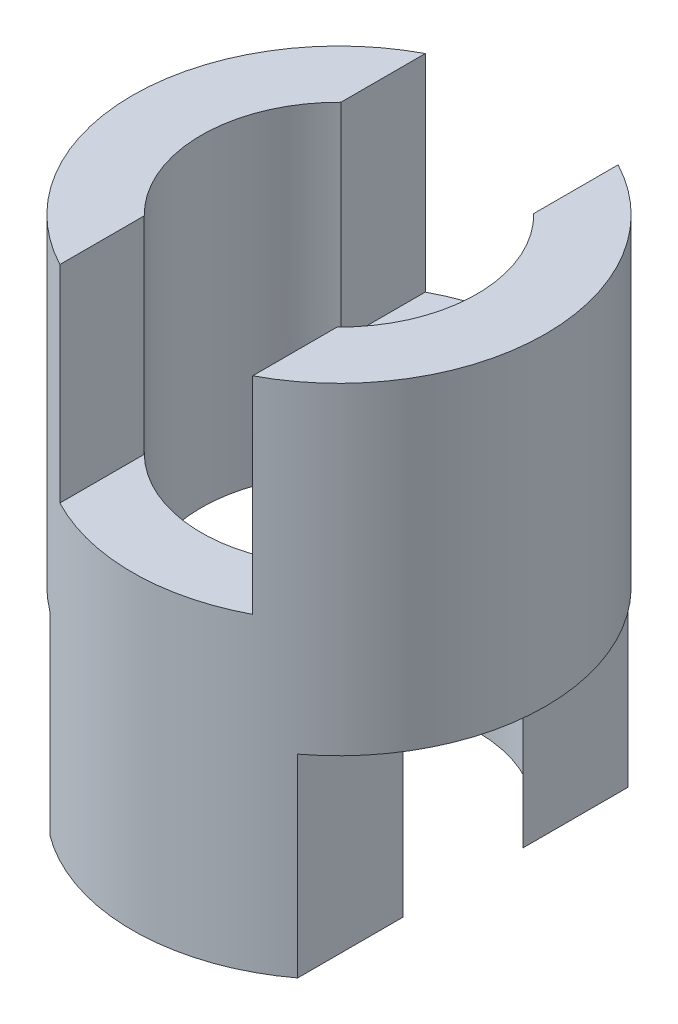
from build123d import *

# Parameters (mm, degrees)
SKETCH_1_R               = 30
EXTRUDE_1_DEPTH          = 75
SKETCH_3_W               = 28
SKETCH_3_H               = 99.473914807
CUT_EXTRUDE_2_DEPTH      = 30
SKETCH_4_R               = 20
CUT_EXTRUDE_3_DEPTH      = 87.168439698
CUT_EXTRUDE_4_DEPTH      = 87.168439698
CUT_EXTRUDE_4_DEPTH_BACK = 87.168439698
SKETCH_5_W               = 18.986467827
SKETCH_5_H               = 32.201049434
SKETCH_5_W_2             = 13.214581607


with BuildPart() as part:
    # Sketch 1 → Extrude 1 (new body)
    with BuildSketch(Plane(origin=(0, 0, 0), x_dir=(1, 0, 0), z_dir=(0, 1, 0))):
        with Locations(Location((0, 0, 0), (0, 0, 270))):
            Circle(SKETCH_1_R)
    extrude(amount=EXTRUDE_1_DEPTH)

    # Sketch 3 → Cut-Extrude 2 (cut)
    with BuildSketch(Plane(origin=(0, 75, 0), x_dir=(1, 0, 0), z_dir=(0, 1, 0))):
        with Locations((0, -2.441866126)):
            Rectangle(SKETCH_3_W, SKETCH_3_H)
    extrude(amount=-CUT_EXTRUDE_2_DEPTH, mode=Mode.SUBTRACT)

    # Sketch 4 → Cut-Extrude 3 (cut, through all)
    with BuildSketch(Plane.XZ):
        with Locations(Location((0, 0, 0), (0, 0, 270))):
            Circle(SKETCH_4_R)
    extrude(amount=-CUT_EXTRUDE_3_DEPTH, mode=Mode.SUBTRACT)

    # Sketch 5 → Cut-Extrude 4 (cut, two sides: drawn at the far end of the back side and taken through both)
    with BuildSketch(Plane.XY.offset(-CUT_EXTRUDE_4_DEPTH_BACK)):
        with Locations((-27.493233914, 12.058133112)):
            Rectangle(SKETCH_5_W, SKETCH_5_H)
        with Locations((24.607290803, 12.058133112)):
            Rectangle(SKETCH_5_W_2, SKETCH_5_H)
    extrude(amount=CUT_EXTRUDE_4_DEPTH + CUT_EXTRUDE_4_DEPTH_BACK, mode=Mode.SUBTRACT)


solid = part.part
